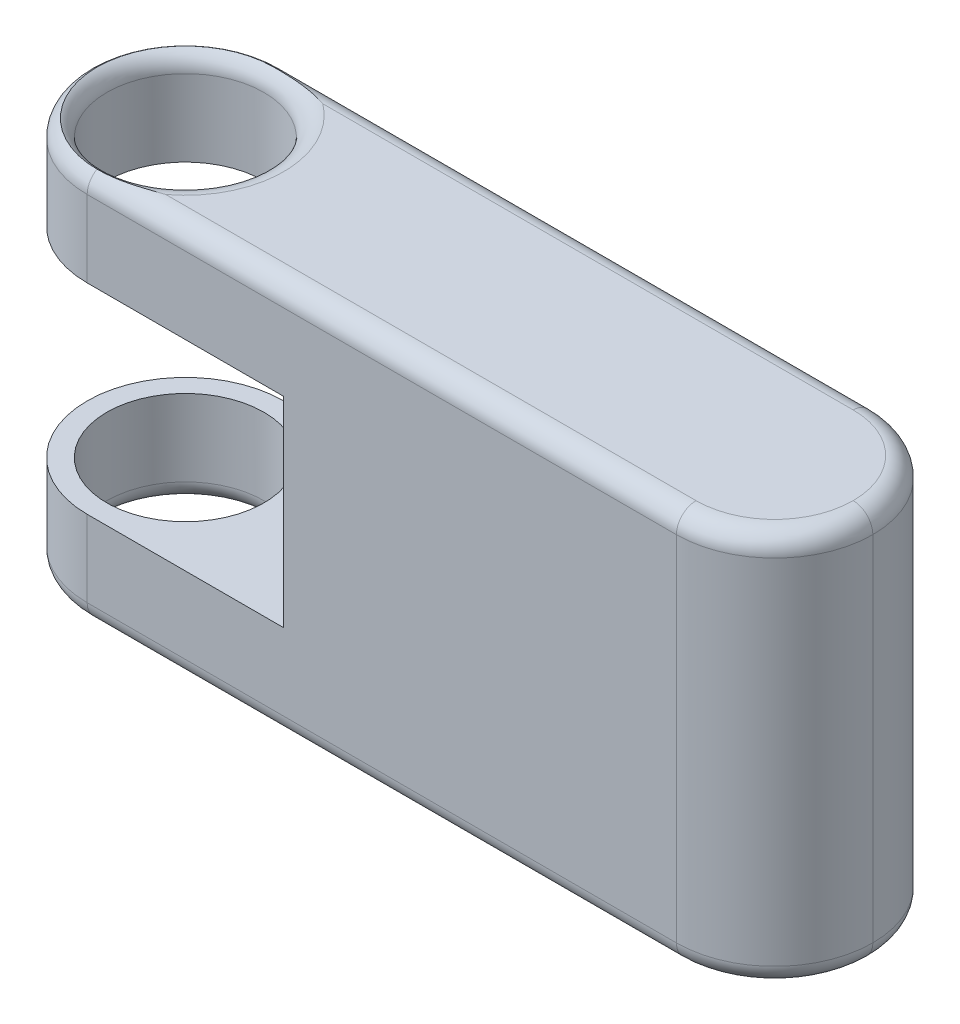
ISO-10303-21;
HEADER;
FILE_DESCRIPTION(('STEP AP214'),'2;1');
FILE_NAME('part.step','',(''),(''),'','','');
FILE_SCHEMA(('AUTOMOTIVE_DESIGN { 1 0 10303 214 1 1 1 1 }'));
ENDSEC;
DATA;
#1=APPLICATION_CONTEXT('core data for automotive mechanical design processes');
#2=APPLICATION_PROTOCOL_DEFINITION('international standard','automotive_design',2000,#1);
#3=PRODUCT_CONTEXT('',#1,'mechanical');
#4=PRODUCT('Part','Part','',(#3));
#5=PRODUCT_RELATED_PRODUCT_CATEGORY('part','',(#4));
#6=PRODUCT_DEFINITION_FORMATION('','',#4);
#7=PRODUCT_DEFINITION_CONTEXT('part definition',#1,'design');
#8=PRODUCT_DEFINITION('design','',#6,#7);
#9=PRODUCT_DEFINITION_SHAPE('','',#8);
#10=(LENGTH_UNIT() NAMED_UNIT(*) SI_UNIT(.MILLI.,.METRE.));
#11=(NAMED_UNIT(*) PLANE_ANGLE_UNIT() SI_UNIT($,.RADIAN.));
#12=(NAMED_UNIT(*) SI_UNIT($,.STERADIAN.) SOLID_ANGLE_UNIT());
#13=UNCERTAINTY_MEASURE_WITH_UNIT(LENGTH_MEASURE(1.E-05),#10,'distance_accuracy_value','');
#14=(GEOMETRIC_REPRESENTATION_CONTEXT(3) GLOBAL_UNCERTAINTY_ASSIGNED_CONTEXT((#13)) GLOBAL_UNIT_ASSIGNED_CONTEXT((#10,
#11,#12)) REPRESENTATION_CONTEXT('',''));
#15=CARTESIAN_POINT('',(0.,0.,0.));
#16=DIRECTION('',(0.,0.,1.));
#17=DIRECTION('',(1.,0.,0.));
#18=AXIS2_PLACEMENT_3D('',#15,#16,#17);
#19=CARTESIAN_POINT('',(150.,-49.,100.));
#20=DIRECTION('',(0.,1.,0.));
#21=DIRECTION('',(-1.,0.,0.));
#22=AXIS2_PLACEMENT_3D('',#19,#20,#21);
#23=PLANE('',#22);
#24=CARTESIAN_POINT('',(50.,-49.0000000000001,50.));
#25=DIRECTION('',(0.,1.,0.));
#26=DIRECTION('',(-1.,0.,0.));
#27=AXIS2_PLACEMENT_3D('',#24,#25,#26);
#28=CIRCLE('',#27,40.);
#29=CARTESIAN_POINT('',(9.99999999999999,-49.0000000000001,50.));
#30=VERTEX_POINT('',#29);
#31=EDGE_CURVE('E378',#30,#30,#28,.T.);
#32=ORIENTED_EDGE('',*,*,#31,.T.);
#33=EDGE_LOOP('',(#32));
#34=FACE_BOUND('',#33,.T.);
#35=CARTESIAN_POINT('',(50.,-49.,50.));
#36=DIRECTION('',(0.,1.,0.));
#37=DIRECTION('',(-1.,0.,0.));
#38=AXIS2_PLACEMENT_3D('',#35,#36,#37);
#39=CIRCLE('',#38,50.);
#40=CARTESIAN_POINT('',(50.,-49.,100.));
#41=VERTEX_POINT('',#40);
#42=CARTESIAN_POINT('',(0.,-49.0000000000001,50.));
#43=VERTEX_POINT('',#42);
#44=EDGE_CURVE('E390',#41,#43,#39,.F.);
#45=ORIENTED_EDGE('',*,*,#44,.T.);
#46=CARTESIAN_POINT('',(50.,-49.,50.));
#47=DIRECTION('',(0.,1.,0.));
#48=DIRECTION('',(-1.,0.,0.));
#49=AXIS2_PLACEMENT_3D('',#46,#47,#48);
#50=CIRCLE('',#49,50.);
#51=CARTESIAN_POINT('',(50.,-49.,0.));
#52=VERTEX_POINT('',#51);
#53=EDGE_CURVE('E400',#43,#52,#50,.F.);
#54=ORIENTED_EDGE('',*,*,#53,.T.);
#55=DIRECTION('',(1.,0.,0.));
#56=VECTOR('',#55,1.);
#57=CARTESIAN_POINT('',(150.,-49.,0.));
#58=LINE('',#57,#56);
#59=CARTESIAN_POINT('',(150.,-49.,0.));
#60=VERTEX_POINT('',#59);
#61=EDGE_CURVE('E364',#52,#60,#58,.T.);
#62=ORIENTED_EDGE('',*,*,#61,.T.);
#63=DIRECTION('',(0.,0.,-1.));
#64=VECTOR('',#63,1.);
#65=CARTESIAN_POINT('',(150.,-49.,100.));
#66=LINE('',#65,#64);
#67=CARTESIAN_POINT('',(150.,-49.,100.));
#68=VERTEX_POINT('',#67);
#69=EDGE_CURVE('E362',#68,#60,#66,.T.);
#70=ORIENTED_EDGE('',*,*,#69,.F.);
#71=DIRECTION('',(1.,0.,0.));
#72=VECTOR('',#71,1.);
#73=CARTESIAN_POINT('',(150.,-49.,100.));
#74=LINE('',#73,#72);
#75=EDGE_CURVE('E346',#41,#68,#74,.T.);
#76=ORIENTED_EDGE('',*,*,#75,.F.);
#77=EDGE_LOOP('',(#45,#54,#62,#70,#76));
#78=FACE_BOUND('',#77,.T.);
#79=ADVANCED_FACE('F37',(#34,#78),#23,.F.);
#80=CARTESIAN_POINT('',(150.,-151.,100.));
#81=DIRECTION('',(1.,0.,0.));
#82=DIRECTION('',(0.,0.,-1.));
#83=AXIS2_PLACEMENT_3D('',#80,#81,#82);
#84=PLANE('',#83);
#85=DIRECTION('',(0.,-1.,0.));
#86=VECTOR('',#85,1.);
#87=CARTESIAN_POINT('',(150.,-151.,0.));
#88=LINE('',#87,#86);
#89=CARTESIAN_POINT('',(150.,-151.,0.));
#90=VERTEX_POINT('',#89);
#91=EDGE_CURVE('E377',#60,#90,#88,.T.);
#92=ORIENTED_EDGE('',*,*,#91,.T.);
#93=DIRECTION('',(0.,0.,-1.));
#94=VECTOR('',#93,1.);
#95=CARTESIAN_POINT('',(150.,-151.,100.));
#96=LINE('',#95,#94);
#97=CARTESIAN_POINT('',(150.,-151.,100.));
#98=VERTEX_POINT('',#97);
#99=EDGE_CURVE('E367',#98,#90,#96,.T.);
#100=ORIENTED_EDGE('',*,*,#99,.F.);
#101=DIRECTION('',(0.,-1.,0.));
#102=VECTOR('',#101,1.);
#103=CARTESIAN_POINT('',(150.,-151.,100.));
#104=LINE('',#103,#102);
#105=EDGE_CURVE('E352',#68,#98,#104,.T.);
#106=ORIENTED_EDGE('',*,*,#105,.F.);
#107=ORIENTED_EDGE('',*,*,#69,.T.);
#108=EDGE_LOOP('',(#92,#100,#106,#107));
#109=FACE_BOUND('',#108,.T.);
#110=ADVANCED_FACE('F140',(#109),#84,.F.);
#111=CARTESIAN_POINT('',(0.,-151.,100.));
#112=DIRECTION('',(0.,-1.,0.));
#113=DIRECTION('',(0.,0.,-1.));
#114=AXIS2_PLACEMENT_3D('',#111,#112,#113);
#115=PLANE('',#114);
#116=CARTESIAN_POINT('',(50.,-151.,50.));
#117=DIRECTION('',(0.,-1.,0.));
#118=DIRECTION('',(0.,0.,-1.));
#119=AXIS2_PLACEMENT_3D('',#116,#117,#118);
#120=CIRCLE('',#119,40.);
#121=CARTESIAN_POINT('',(50.,-151.,10.));
#122=VERTEX_POINT('',#121);
#123=EDGE_CURVE('E462',#122,#122,#120,.T.);
#124=ORIENTED_EDGE('',*,*,#123,.T.);
#125=EDGE_LOOP('',(#124));
#126=FACE_BOUND('',#125,.T.);
#127=DIRECTION('',(-1.,0.,0.));
#128=VECTOR('',#127,1.);
#129=CARTESIAN_POINT('',(0.,-151.,0.));
#130=LINE('',#129,#128);
#131=CARTESIAN_POINT('',(50.,-151.,0.));
#132=VERTEX_POINT('',#131);
#133=EDGE_CURVE('E359',#90,#132,#130,.T.);
#134=ORIENTED_EDGE('',*,*,#133,.T.);
#135=CARTESIAN_POINT('',(50.,-151.,50.));
#136=DIRECTION('',(0.,-1.,0.));
#137=DIRECTION('',(0.,0.,-1.));
#138=AXIS2_PLACEMENT_3D('',#135,#136,#137);
#139=CIRCLE('',#138,50.);
#140=CARTESIAN_POINT('',(0.,-151.,50.));
#141=VERTEX_POINT('',#140);
#142=EDGE_CURVE('E397',#132,#141,#139,.F.);
#143=ORIENTED_EDGE('',*,*,#142,.T.);
#144=CARTESIAN_POINT('',(50.,-151.,50.));
#145=DIRECTION('',(0.,-1.,0.));
#146=DIRECTION('',(0.,0.,-1.));
#147=AXIS2_PLACEMENT_3D('',#144,#145,#146);
#148=CIRCLE('',#147,50.);
#149=CARTESIAN_POINT('',(50.,-151.,100.));
#150=VERTEX_POINT('',#149);
#151=EDGE_CURVE('E387',#141,#150,#148,.F.);
#152=ORIENTED_EDGE('',*,*,#151,.T.);
#153=DIRECTION('',(-1.,0.,0.));
#154=VECTOR('',#153,1.);
#155=CARTESIAN_POINT('',(0.,-151.,100.));
#156=LINE('',#155,#154);
#157=EDGE_CURVE('E371',#98,#150,#156,.T.);
#158=ORIENTED_EDGE('',*,*,#157,.F.);
#159=ORIENTED_EDGE('',*,*,#99,.T.);
#160=EDGE_LOOP('',(#134,#143,#152,#158,#159));
#161=FACE_BOUND('',#160,.T.);
#162=ADVANCED_FACE('F146',(#126,#161),#115,.F.);
#163=CARTESIAN_POINT('',(400.,-200.,100.));
#164=DIRECTION('',(0.,1.,0.));
#165=DIRECTION('',(-1.,0.,0.));
#166=AXIS2_PLACEMENT_3D('',#163,#164,#165);
#167=PLANE('',#166);
#168=CARTESIAN_POINT('',(350.,-200.,50.));
#169=DIRECTION('',(0.,1.,0.));
#170=DIRECTION('',(-1.,0.,0.));
#171=AXIS2_PLACEMENT_3D('',#168,#169,#170);
#172=CIRCLE('',#171,40.);
#173=CARTESIAN_POINT('',(390.,-200.,50.));
#174=VERTEX_POINT('',#173);
#175=CARTESIAN_POINT('',(350.,-200.,90.0000000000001));
#176=VERTEX_POINT('',#175);
#177=EDGE_CURVE('E56',#174,#176,#172,.F.);
#178=ORIENTED_EDGE('',*,*,#177,.T.);
#179=DIRECTION('',(1.,0.,0.));
#180=VECTOR('',#179,1.);
#181=CARTESIAN_POINT('',(400.,-200.,90.0000000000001));
#182=LINE('',#181,#180);
#183=CARTESIAN_POINT('',(79.9999999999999,-200.,90.0000000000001));
#184=VERTEX_POINT('',#183);
#185=EDGE_CURVE('E47',#176,#184,#182,.F.);
#186=ORIENTED_EDGE('',*,*,#185,.T.);
#187=CARTESIAN_POINT('',(50.,-200.,50.));
#188=DIRECTION('',(0.,1.,0.));
#189=DIRECTION('',(-1.,0.,0.));
#190=AXIS2_PLACEMENT_3D('',#187,#188,#189);
#191=CIRCLE('',#190,50.);
#192=CARTESIAN_POINT('',(80.,-200.,10.));
#193=VERTEX_POINT('',#192);
#194=EDGE_CURVE('E109',#184,#193,#191,.T.);
#195=ORIENTED_EDGE('',*,*,#194,.T.);
#196=DIRECTION('',(1.,0.,0.));
#197=VECTOR('',#196,1.);
#198=CARTESIAN_POINT('',(350.,-200.,10.));
#199=LINE('',#198,#197);
#200=CARTESIAN_POINT('',(350.,-200.,10.));
#201=VERTEX_POINT('',#200);
#202=EDGE_CURVE('E245',#193,#201,#199,.T.);
#203=ORIENTED_EDGE('',*,*,#202,.T.);
#204=CARTESIAN_POINT('',(350.,-200.,50.));
#205=DIRECTION('',(0.,1.,0.));
#206=DIRECTION('',(-1.,0.,0.));
#207=AXIS2_PLACEMENT_3D('',#204,#205,#206);
#208=CIRCLE('',#207,40.);
#209=EDGE_CURVE('E251',#201,#174,#208,.F.);
#210=ORIENTED_EDGE('',*,*,#209,.T.);
#211=EDGE_LOOP('',(#178,#186,#195,#203,#210));
#212=FACE_BOUND('',#211,.T.);
#213=ADVANCED_FACE('F258',(#212),#167,.F.);
#214=CARTESIAN_POINT('',(0.,0.,100.));
#215=DIRECTION('',(0.,-1.,0.));
#216=DIRECTION('',(0.,0.,-1.));
#217=AXIS2_PLACEMENT_3D('',#214,#215,#216);
#218=PLANE('',#217);
#219=CARTESIAN_POINT('',(350.,0.,50.));
#220=DIRECTION('',(0.,-1.,0.));
#221=DIRECTION('',(0.,0.,-1.));
#222=AXIS2_PLACEMENT_3D('',#219,#220,#221);
#223=CIRCLE('',#222,40.);
#224=CARTESIAN_POINT('',(350.,0.,90.0000000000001));
#225=VERTEX_POINT('',#224);
#226=CARTESIAN_POINT('',(390.,0.,50.));
#227=VERTEX_POINT('',#226);
#228=EDGE_CURVE('E422',#225,#227,#223,.F.);
#229=ORIENTED_EDGE('',*,*,#228,.T.);
#230=CARTESIAN_POINT('',(350.,0.,50.));
#231=DIRECTION('',(0.,-1.,0.));
#232=DIRECTION('',(0.,0.,-1.));
#233=AXIS2_PLACEMENT_3D('',#230,#231,#232);
#234=CIRCLE('',#233,40.);
#235=CARTESIAN_POINT('',(350.,0.,10.));
#236=VERTEX_POINT('',#235);
#237=EDGE_CURVE('E424',#227,#236,#234,.F.);
#238=ORIENTED_EDGE('',*,*,#237,.T.);
#239=DIRECTION('',(-1.,0.,0.));
#240=VECTOR('',#239,1.);
#241=CARTESIAN_POINT('',(50.,0.,10.));
#242=LINE('',#241,#240);
#243=CARTESIAN_POINT('',(80.,0.,10.));
#244=VERTEX_POINT('',#243);
#245=EDGE_CURVE('E417',#236,#244,#242,.T.);
#246=ORIENTED_EDGE('',*,*,#245,.T.);
#247=CARTESIAN_POINT('',(50.,0.,50.));
#248=DIRECTION('',(0.,-1.,0.));
#249=DIRECTION('',(0.,0.,-1.));
#250=AXIS2_PLACEMENT_3D('',#247,#248,#249);
#251=CIRCLE('',#250,50.);
#252=CARTESIAN_POINT('',(79.9999999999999,0.,90.0000000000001));
#253=VERTEX_POINT('',#252);
#254=EDGE_CURVE('E415',#244,#253,#251,.T.);
#255=ORIENTED_EDGE('',*,*,#254,.T.);
#256=DIRECTION('',(-1.,0.,0.));
#257=VECTOR('',#256,1.);
#258=CARTESIAN_POINT('',(0.,0.,90.0000000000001));
#259=LINE('',#258,#257);
#260=EDGE_CURVE('E419',#253,#225,#259,.F.);
#261=ORIENTED_EDGE('',*,*,#260,.T.);
#262=EDGE_LOOP('',(#229,#238,#246,#255,#261));
#263=FACE_BOUND('',#262,.T.);
#264=ADVANCED_FACE('F489',(#263),#218,.F.);
#265=CARTESIAN_POINT('',(0.,0.,100.));
#266=DIRECTION('',(0.,0.,-1.));
#267=DIRECTION('',(-1.,0.,0.));
#268=AXIS2_PLACEMENT_3D('',#265,#266,#267);
#269=PLANE('',#268);
#270=DIRECTION('',(0.,1.,0.));
#271=VECTOR('',#270,1.);
#272=CARTESIAN_POINT('',(350.,0.,100.));
#273=LINE('',#272,#271);
#274=CARTESIAN_POINT('',(350.,-190.,100.));
#275=VERTEX_POINT('',#274);
#276=CARTESIAN_POINT('',(350.,-10.0000000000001,100.));
#277=VERTEX_POINT('',#276);
#278=EDGE_CURVE('E405',#275,#277,#273,.T.);
#279=ORIENTED_EDGE('',*,*,#278,.T.);
#280=DIRECTION('',(-1.,0.,0.));
#281=VECTOR('',#280,1.);
#282=CARTESIAN_POINT('',(0.,-10.0000000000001,100.));
#283=LINE('',#282,#281);
#284=CARTESIAN_POINT('',(50.,-10.0000000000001,100.));
#285=VERTEX_POINT('',#284);
#286=EDGE_CURVE('E413',#277,#285,#283,.T.);
#287=ORIENTED_EDGE('',*,*,#286,.T.);
#288=DIRECTION('',(0.,-1.,0.));
#289=VECTOR('',#288,1.);
#290=CARTESIAN_POINT('',(50.,0.,100.));
#291=LINE('',#290,#289);
#292=EDGE_CURVE('E356',#285,#41,#291,.T.);
#293=ORIENTED_EDGE('',*,*,#292,.T.);
#294=ORIENTED_EDGE('',*,*,#75,.T.);
#295=ORIENTED_EDGE('',*,*,#105,.T.);
#296=ORIENTED_EDGE('',*,*,#157,.T.);
#297=DIRECTION('',(0.,-1.,0.));
#298=VECTOR('',#297,1.);
#299=CARTESIAN_POINT('',(50.,0.,100.));
#300=LINE('',#299,#298);
#301=CARTESIAN_POINT('',(50.,-190.,100.));
#302=VERTEX_POINT('',#301);
#303=EDGE_CURVE('E366',#150,#302,#300,.T.);
#304=ORIENTED_EDGE('',*,*,#303,.T.);
#305=DIRECTION('',(1.,0.,0.));
#306=VECTOR('',#305,1.);
#307=CARTESIAN_POINT('',(0.,-190.,100.));
#308=LINE('',#307,#306);
#309=EDGE_CURVE('E95',#302,#275,#308,.T.);
#310=ORIENTED_EDGE('',*,*,#309,.T.);
#311=EDGE_LOOP('',(#279,#287,#293,#294,#295,#296,#304,#310));
#312=FACE_BOUND('',#311,.T.);
#313=ADVANCED_FACE('F349',(#312),#269,.F.);
#314=CARTESIAN_POINT('',(0.,0.,0.));
#315=DIRECTION('',(0.,0.,-1.));
#316=DIRECTION('',(-1.,0.,0.));
#317=AXIS2_PLACEMENT_3D('',#314,#315,#316);
#318=PLANE('',#317);
#319=DIRECTION('',(0.,-1.,0.));
#320=VECTOR('',#319,1.);
#321=CARTESIAN_POINT('',(50.,0.,0.));
#322=LINE('',#321,#320);
#323=CARTESIAN_POINT('',(50.,-10.0000000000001,0.));
#324=VERTEX_POINT('',#323);
#325=EDGE_CURVE('E402',#52,#324,#322,.F.);
#326=ORIENTED_EDGE('',*,*,#325,.T.);
#327=DIRECTION('',(-1.,0.,0.));
#328=VECTOR('',#327,1.);
#329=CARTESIAN_POINT('',(350.,-10.0000000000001,0.));
#330=LINE('',#329,#328);
#331=CARTESIAN_POINT('',(350.,-10.0000000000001,0.));
#332=VERTEX_POINT('',#331);
#333=EDGE_CURVE('E432',#324,#332,#330,.F.);
#334=ORIENTED_EDGE('',*,*,#333,.T.);
#335=DIRECTION('',(0.,1.,0.));
#336=VECTOR('',#335,1.);
#337=CARTESIAN_POINT('',(350.,-200.,0.));
#338=LINE('',#337,#336);
#339=CARTESIAN_POINT('',(350.,-190.,0.));
#340=VERTEX_POINT('',#339);
#341=EDGE_CURVE('E409',#332,#340,#338,.F.);
#342=ORIENTED_EDGE('',*,*,#341,.T.);
#343=DIRECTION('',(1.,0.,0.));
#344=VECTOR('',#343,1.);
#345=CARTESIAN_POINT('',(50.,-190.,0.));
#346=LINE('',#345,#344);
#347=CARTESIAN_POINT('',(50.,-190.,0.));
#348=VERTEX_POINT('',#347);
#349=EDGE_CURVE('E430',#340,#348,#346,.F.);
#350=ORIENTED_EDGE('',*,*,#349,.T.);
#351=DIRECTION('',(0.,-1.,0.));
#352=VECTOR('',#351,1.);
#353=CARTESIAN_POINT('',(50.,-151.,0.));
#354=LINE('',#353,#352);
#355=EDGE_CURVE('E395',#348,#132,#354,.F.);
#356=ORIENTED_EDGE('',*,*,#355,.T.);
#357=ORIENTED_EDGE('',*,*,#133,.F.);
#358=ORIENTED_EDGE('',*,*,#91,.F.);
#359=ORIENTED_EDGE('',*,*,#61,.F.);
#360=EDGE_LOOP('',(#326,#334,#342,#350,#356,#357,#358,#359));
#361=FACE_BOUND('',#360,.T.);
#362=ADVANCED_FACE('F496',(#361),#318,.T.);
#363=CARTESIAN_POINT('',(50.,-200.,50.));
#364=DIRECTION('',(0.,1.,0.));
#365=DIRECTION('',(0.,0.,1.));
#366=AXIS2_PLACEMENT_3D('',#363,#364,#365);
#367=CYLINDRICAL_SURFACE('',#366,40.);
#368=CARTESIAN_POINT('',(50.,-10.0000000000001,50.));
#369=DIRECTION('',(0.,-1.,0.));
#370=DIRECTION('',(0.,0.,-1.));
#371=AXIS2_PLACEMENT_3D('',#368,#369,#370);
#372=CIRCLE('',#371,40.);
#373=CARTESIAN_POINT('',(50.,-10.0000000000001,10.));
#374=VERTEX_POINT('',#373);
#375=EDGE_CURVE('E440',#374,#374,#372,.F.);
#376=ORIENTED_EDGE('',*,*,#375,.T.);
#377=EDGE_LOOP('',(#376));
#378=FACE_BOUND('',#377,.T.);
#379=ORIENTED_EDGE('',*,*,#31,.F.);
#380=EDGE_LOOP('',(#379));
#381=FACE_BOUND('',#380,.T.);
#382=ADVANCED_FACE('F505',(#378,#381),#367,.F.);
#383=CARTESIAN_POINT('',(50.,-190.,50.));
#384=DIRECTION('',(0.,1.,0.));
#385=DIRECTION('',(-1.,0.,0.));
#386=AXIS2_PLACEMENT_3D('',#383,#384,#385);
#387=CIRCLE('',#386,40.);
#388=CARTESIAN_POINT('',(9.99999999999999,-190.,50.));
#389=VERTEX_POINT('',#388);
#390=EDGE_CURVE('E11',#389,#389,#387,.F.);
#391=ORIENTED_EDGE('',*,*,#390,.T.);
#392=EDGE_LOOP('',(#391));
#393=FACE_BOUND('',#392,.T.);
#394=ORIENTED_EDGE('',*,*,#123,.F.);
#395=EDGE_LOOP('',(#394));
#396=FACE_BOUND('',#395,.T.);
#397=ADVANCED_FACE('F157',(#393,#396),#367,.F.);
#398=CARTESIAN_POINT('',(50.,0.,50.));
#399=DIRECTION('',(0.,-1.,0.));
#400=DIRECTION('',(0.,0.,-1.));
#401=AXIS2_PLACEMENT_3D('',#398,#399,#400);
#402=CYLINDRICAL_SURFACE('',#401,50.);
#403=DIRECTION('',(0.,-1.,0.));
#404=VECTOR('',#403,1.);
#405=CARTESIAN_POINT('',(0.,-200.,50.));
#406=LINE('',#405,#404);
#407=CARTESIAN_POINT('',(0.,-190.,50.));
#408=VERTEX_POINT('',#407);
#409=EDGE_CURVE('E385',#408,#141,#406,.F.);
#410=ORIENTED_EDGE('',*,*,#409,.F.);
#411=CARTESIAN_POINT('',(50.,-190.,50.));
#412=DIRECTION('',(0.,1.,0.));
#413=DIRECTION('',(-1.,0.,0.));
#414=AXIS2_PLACEMENT_3D('',#411,#412,#413);
#415=CIRCLE('',#414,50.);
#416=EDGE_CURVE('E254',#408,#302,#415,.T.);
#417=ORIENTED_EDGE('',*,*,#416,.T.);
#418=ORIENTED_EDGE('',*,*,#303,.F.);
#419=ORIENTED_EDGE('',*,*,#151,.F.);
#420=EDGE_LOOP('',(#410,#417,#418,#419));
#421=FACE_BOUND('',#420,.T.);
#422=ADVANCED_FACE('F153',(#421),#402,.T.);
#423=CARTESIAN_POINT('',(50.,0.,50.));
#424=DIRECTION('',(0.,-1.,0.));
#425=DIRECTION('',(0.,0.,-1.));
#426=AXIS2_PLACEMENT_3D('',#423,#424,#425);
#427=CYLINDRICAL_SURFACE('',#426,50.);
#428=ORIENTED_EDGE('',*,*,#292,.F.);
#429=CARTESIAN_POINT('',(50.,-10.0000000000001,50.));
#430=DIRECTION('',(0.,-1.,0.));
#431=DIRECTION('',(0.,0.,-1.));
#432=AXIS2_PLACEMENT_3D('',#429,#430,#431);
#433=CIRCLE('',#432,50.);
#434=CARTESIAN_POINT('',(0.,-10.0000000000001,50.));
#435=VERTEX_POINT('',#434);
#436=EDGE_CURVE('E426',#285,#435,#433,.T.);
#437=ORIENTED_EDGE('',*,*,#436,.T.);
#438=DIRECTION('',(0.,-1.,0.));
#439=VECTOR('',#438,1.);
#440=CARTESIAN_POINT('',(0.,-49.0000000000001,50.));
#441=LINE('',#440,#439);
#442=EDGE_CURVE('E392',#43,#435,#441,.F.);
#443=ORIENTED_EDGE('',*,*,#442,.F.);
#444=ORIENTED_EDGE('',*,*,#44,.F.);
#445=EDGE_LOOP('',(#428,#437,#443,#444));
#446=FACE_BOUND('',#445,.T.);
#447=ADVANCED_FACE('F156',(#446),#427,.T.);
#448=CARTESIAN_POINT('',(50.,-200.,50.));
#449=DIRECTION('',(0.,1.,0.));
#450=DIRECTION('',(0.,0.,1.));
#451=AXIS2_PLACEMENT_3D('',#448,#449,#450);
#452=CYLINDRICAL_SURFACE('',#451,50.);
#453=ORIENTED_EDGE('',*,*,#355,.F.);
#454=CARTESIAN_POINT('',(50.,-190.,50.));
#455=DIRECTION('',(0.,1.,0.));
#456=DIRECTION('',(-1.,0.,0.));
#457=AXIS2_PLACEMENT_3D('',#454,#455,#456);
#458=CIRCLE('',#457,50.);
#459=EDGE_CURVE('E443',#348,#408,#458,.T.);
#460=ORIENTED_EDGE('',*,*,#459,.T.);
#461=ORIENTED_EDGE('',*,*,#409,.T.);
#462=ORIENTED_EDGE('',*,*,#142,.F.);
#463=EDGE_LOOP('',(#453,#460,#461,#462));
#464=FACE_BOUND('',#463,.T.);
#465=ADVANCED_FACE('F161',(#464),#452,.T.);
#466=CARTESIAN_POINT('',(50.,-49.0000000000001,50.));
#467=DIRECTION('',(0.,1.,0.));
#468=DIRECTION('',(0.,0.,1.));
#469=AXIS2_PLACEMENT_3D('',#466,#467,#468);
#470=CYLINDRICAL_SURFACE('',#469,50.);
#471=ORIENTED_EDGE('',*,*,#442,.T.);
#472=CARTESIAN_POINT('',(50.,-10.0000000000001,50.));
#473=DIRECTION('',(0.,-1.,0.));
#474=DIRECTION('',(0.,0.,-1.));
#475=AXIS2_PLACEMENT_3D('',#472,#473,#474);
#476=CIRCLE('',#475,50.);
#477=EDGE_CURVE('E428',#435,#324,#476,.T.);
#478=ORIENTED_EDGE('',*,*,#477,.T.);
#479=ORIENTED_EDGE('',*,*,#325,.F.);
#480=ORIENTED_EDGE('',*,*,#53,.F.);
#481=EDGE_LOOP('',(#471,#478,#479,#480));
#482=FACE_BOUND('',#481,.T.);
#483=ADVANCED_FACE('F165',(#482),#470,.T.);
#484=CARTESIAN_POINT('',(350.,0.,50.));
#485=DIRECTION('',(0.,1.,0.));
#486=DIRECTION('',(0.,0.,1.));
#487=AXIS2_PLACEMENT_3D('',#484,#485,#486);
#488=CYLINDRICAL_SURFACE('',#487,50.);
#489=DIRECTION('',(0.,1.,0.));
#490=VECTOR('',#489,1.);
#491=CARTESIAN_POINT('',(400.,0.,50.));
#492=LINE('',#491,#490);
#493=CARTESIAN_POINT('',(400.,-10.0000000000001,50.));
#494=VERTEX_POINT('',#493);
#495=CARTESIAN_POINT('',(400.,-190.,50.));
#496=VERTEX_POINT('',#495);
#497=EDGE_CURVE('E407',#494,#496,#492,.F.);
#498=ORIENTED_EDGE('',*,*,#497,.F.);
#499=CARTESIAN_POINT('',(350.,-10.0000000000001,50.));
#500=DIRECTION('',(0.,-1.,0.));
#501=DIRECTION('',(0.,0.,-1.));
#502=AXIS2_PLACEMENT_3D('',#499,#500,#501);
#503=CIRCLE('',#502,50.);
#504=EDGE_CURVE('E438',#494,#277,#503,.T.);
#505=ORIENTED_EDGE('',*,*,#504,.T.);
#506=ORIENTED_EDGE('',*,*,#278,.F.);
#507=CARTESIAN_POINT('',(350.,-190.,50.));
#508=DIRECTION('',(0.,1.,0.));
#509=DIRECTION('',(-1.,0.,0.));
#510=AXIS2_PLACEMENT_3D('',#507,#508,#509);
#511=CIRCLE('',#510,50.);
#512=EDGE_CURVE('E273',#275,#496,#511,.T.);
#513=ORIENTED_EDGE('',*,*,#512,.T.);
#514=EDGE_LOOP('',(#498,#505,#506,#513));
#515=FACE_BOUND('',#514,.T.);
#516=ADVANCED_FACE('F169',(#515),#488,.T.);
#517=CARTESIAN_POINT('',(350.,0.,50.));
#518=DIRECTION('',(0.,-1.,0.));
#519=DIRECTION('',(0.,0.,-1.));
#520=AXIS2_PLACEMENT_3D('',#517,#518,#519);
#521=CYLINDRICAL_SURFACE('',#520,50.);
#522=ORIENTED_EDGE('',*,*,#341,.F.);
#523=CARTESIAN_POINT('',(350.,-10.0000000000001,50.));
#524=DIRECTION('',(0.,-1.,0.));
#525=DIRECTION('',(0.,0.,-1.));
#526=AXIS2_PLACEMENT_3D('',#523,#524,#525);
#527=CIRCLE('',#526,50.);
#528=EDGE_CURVE('E435',#332,#494,#527,.T.);
#529=ORIENTED_EDGE('',*,*,#528,.T.);
#530=ORIENTED_EDGE('',*,*,#497,.T.);
#531=CARTESIAN_POINT('',(350.,-190.,50.));
#532=DIRECTION('',(0.,1.,0.));
#533=DIRECTION('',(-1.,0.,0.));
#534=AXIS2_PLACEMENT_3D('',#531,#532,#533);
#535=CIRCLE('',#534,50.);
#536=EDGE_CURVE('E271',#496,#340,#535,.T.);
#537=ORIENTED_EDGE('',*,*,#536,.T.);
#538=EDGE_LOOP('',(#522,#529,#530,#537));
#539=FACE_BOUND('',#538,.T.);
#540=ADVANCED_FACE('F173',(#539),#521,.T.);
#541=CARTESIAN_POINT('',(350.,-10.0000000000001,50.));
#542=DIRECTION('',(0.,-1.,0.));
#543=DIRECTION('',(0.,0.,-1.));
#544=AXIS2_PLACEMENT_3D('',#541,#542,#543);
#545=TOROIDAL_SURFACE('',#544,40.,10.);
#546=CARTESIAN_POINT('',(390.,-10.0000000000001,50.));
#547=DIRECTION('',(0.,0.,1.));
#548=DIRECTION('',(1.,0.,0.));
#549=AXIS2_PLACEMENT_3D('',#546,#547,#548);
#550=CIRCLE('',#549,10.);
#551=EDGE_CURVE('E466',#494,#227,#550,.T.);
#552=ORIENTED_EDGE('',*,*,#551,.F.);
#553=ORIENTED_EDGE('',*,*,#528,.F.);
#554=CARTESIAN_POINT('',(350.,-10.0000000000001,10.));
#555=DIRECTION('',(-1.,0.,0.));
#556=DIRECTION('',(0.,0.,1.));
#557=AXIS2_PLACEMENT_3D('',#554,#555,#556);
#558=CIRCLE('',#557,10.);
#559=EDGE_CURVE('E463',#236,#332,#558,.T.);
#560=ORIENTED_EDGE('',*,*,#559,.F.);
#561=ORIENTED_EDGE('',*,*,#237,.F.);
#562=EDGE_LOOP('',(#552,#553,#560,#561));
#563=FACE_BOUND('',#562,.T.);
#564=ADVANCED_FACE('F177',(#563),#545,.T.);
#565=CARTESIAN_POINT('',(50.,-10.0000000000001,50.));
#566=DIRECTION('',(0.,-1.,0.));
#567=DIRECTION('',(0.,0.,-1.));
#568=AXIS2_PLACEMENT_3D('',#565,#566,#567);
#569=TOROIDAL_SURFACE('',#568,40.,10.);
#570=CARTESIAN_POINT('',(50.,-10.0000000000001,10.));
#571=DIRECTION('',(1.,0.,0.));
#572=DIRECTION('',(0.,0.,-1.));
#573=AXIS2_PLACEMENT_3D('',#570,#571,#572);
#574=CIRCLE('',#573,10.);
#575=CARTESIAN_POINT('',(50.0000000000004,-1.33974596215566,5.00000000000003));
#576=VERTEX_POINT('',#575);
#577=EDGE_CURVE('E459',#324,#576,#574,.T.);
#578=ORIENTED_EDGE('',*,*,#577,.F.);
#579=ORIENTED_EDGE('',*,*,#477,.F.);
#580=CARTESIAN_POINT('',(10.,-10.0000000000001,50.));
#581=DIRECTION('',(0.,0.,1.));
#582=DIRECTION('',(1.,0.,0.));
#583=AXIS2_PLACEMENT_3D('',#580,#581,#582);
#584=CIRCLE('',#583,10.);
#585=CARTESIAN_POINT('',(5.,-1.33974596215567,50.));
#586=VERTEX_POINT('',#585);
#587=EDGE_CURVE('E469',#586,#435,#584,.T.);
#588=ORIENTED_EDGE('',*,*,#587,.F.);
#589=CARTESIAN_POINT('',(50.,-1.33974596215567,50.));
#590=DIRECTION('',(0.,-1.,0.));
#591=DIRECTION('',(0.,0.,-1.));
#592=AXIS2_PLACEMENT_3D('',#589,#590,#591);
#593=CIRCLE('',#592,45.);
#594=EDGE_CURVE('E208',#576,#586,#593,.F.);
#595=ORIENTED_EDGE('',*,*,#594,.F.);
#596=EDGE_LOOP('',(#578,#579,#588,#595));
#597=FACE_BOUND('',#596,.T.);
#598=ADVANCED_FACE('F222',(#597),#569,.T.);
#599=CARTESIAN_POINT('',(0.,-10.0000000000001,10.));
#600=DIRECTION('',(1.,0.,0.));
#601=DIRECTION('',(0.,0.,-1.));
#602=AXIS2_PLACEMENT_3D('',#599,#600,#601);
#603=CYLINDRICAL_SURFACE('',#602,10.);
#604=ORIENTED_EDGE('',*,*,#333,.F.);
#605=ORIENTED_EDGE('',*,*,#577,.T.);
#606=CARTESIAN_POINT('',(49.9998,-1.33974596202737,5.00000000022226));
#607=CARTESIAN_POINT('',(50.4207233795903,-1.33975555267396,4.99999800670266));
#608=CARTESIAN_POINT('',(50.8416457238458,-1.33804238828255,5.00295104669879));
#609=CARTESIAN_POINT('',(51.6833774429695,-1.33123650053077,5.01475934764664));
#610=CARTESIAN_POINT('',(52.1041868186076,-1.32614380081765,5.0236145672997));
#611=CARTESIAN_POINT('',(52.9455484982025,-1.31264541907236,5.0472182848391));
#612=CARTESIAN_POINT('',(53.3661008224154,-1.30424004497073,5.06196623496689));
#613=CARTESIAN_POINT('',(54.2068790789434,-1.28424841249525,5.0973393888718));
#614=CARTESIAN_POINT('',(54.6271050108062,-1.27266214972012,5.11796460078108));
#615=CARTESIAN_POINT('',(55.8866621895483,-1.23339304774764,5.18860044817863));
#616=CARTESIAN_POINT('',(56.7253802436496,-1.20119137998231,5.24738557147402));
#617=CARTESIAN_POINT('',(58.4004037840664,-1.12660938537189,5.38814037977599));
#618=CARTESIAN_POINT('',(59.2367092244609,-1.08422886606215,5.47011050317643));
#619=CARTESIAN_POINT('',(60.9059977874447,-0.991756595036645,5.65691351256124));
#620=CARTESIAN_POINT('',(61.7389820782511,-0.941667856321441,5.76173747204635));
#621=CARTESIAN_POINT('',(63.4014898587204,-0.836611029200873,5.99393844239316));
#622=CARTESIAN_POINT('',(64.2310133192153,-0.781642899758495,6.12131564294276));
#623=CARTESIAN_POINT('',(65.8862048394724,-0.669954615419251,6.39825888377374));
#624=CARTESIAN_POINT('',(66.7118729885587,-0.613234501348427,6.54782440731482));
#625=CARTESIAN_POINT('',(68.3590336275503,-0.501359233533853,6.86875473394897));
#626=CARTESIAN_POINT('',(69.1805262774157,-0.446204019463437,7.04011869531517));
#627=CARTESIAN_POINT('',(70.8418727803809,-0.33944948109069,7.4093032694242));
#628=CARTESIAN_POINT('',(71.6816018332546,-0.287991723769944,7.60772716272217));
#629=CARTESIAN_POINT('',(73.3560029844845,-0.194283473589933,8.02667796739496));
#630=CARTESIAN_POINT('',(74.1906753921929,-0.152032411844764,8.24720351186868));
#631=CARTESIAN_POINT('',(75.8539339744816,-0.0808437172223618,8.70963794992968));
#632=CARTESIAN_POINT('',(76.6825244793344,-0.0518954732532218,8.9515296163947));
#633=CARTESIAN_POINT('',(78.3337139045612,-0.0115875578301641,9.45621062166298));
#634=CARTESIAN_POINT('',(79.1563135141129,-0.000225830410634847,9.71899751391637));
#635=CARTESIAN_POINT('',(79.9836697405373,-1.11302372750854E-06,9.99455769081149));
#636=CARTESIAN_POINT('',(79.9918350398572,-1.95356823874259E-09,9.99727834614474));
#637=CARTESIAN_POINT('',(80.,4.11223297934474E-13,10.));
#638=B_SPLINE_CURVE_WITH_KNOTS('',3,(#606,#607,#608,#609,#610,#611,#612,#613,#614,#615,#616,
#617,#618,#619,#620,#621,#622,#623,#624,#625,#626,#627,#628,#629,#630,#631,#632,#633,#634,#635,
#636,#637),.UNSPECIFIED.,.F.,.F.,(4,2,2,2,2,2,2,2,2,2,2,2,2,2,2,4),(0.,1.26275443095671,
2.52550002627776,3.78812827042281,5.05075826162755,7.57449583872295,10.0982811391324,
12.6210824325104,15.1439049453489,17.6666687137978,20.1893350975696,22.7821647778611,
25.3748342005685,27.9654319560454,30.5557268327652,30.5815467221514),.UNSPECIFIED.);
#639=EDGE_CURVE('E199',#244,#576,#638,.F.);
#640=ORIENTED_EDGE('',*,*,#639,.F.);
#641=ORIENTED_EDGE('',*,*,#245,.F.);
#642=ORIENTED_EDGE('',*,*,#559,.T.);
#643=EDGE_LOOP('',(#604,#605,#640,#641,#642));
#644=FACE_BOUND('',#643,.T.);
#645=ADVANCED_FACE('F210',(#644),#603,.T.);
#646=CARTESIAN_POINT('',(350.,-10.0000000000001,50.));
#647=DIRECTION('',(0.,-1.,0.));
#648=DIRECTION('',(0.,0.,-1.));
#649=AXIS2_PLACEMENT_3D('',#646,#647,#648);
#650=TOROIDAL_SURFACE('',#649,40.,10.);
#651=ORIENTED_EDGE('',*,*,#551,.T.);
#652=ORIENTED_EDGE('',*,*,#228,.F.);
#653=CARTESIAN_POINT('',(350.,-10.0000000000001,90.0000000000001));
#654=DIRECTION('',(-1.,0.,0.));
#655=DIRECTION('',(0.,0.,1.));
#656=AXIS2_PLACEMENT_3D('',#653,#654,#655);
#657=CIRCLE('',#656,10.);
#658=EDGE_CURVE('E196',#277,#225,#657,.T.);
#659=ORIENTED_EDGE('',*,*,#658,.F.);
#660=ORIENTED_EDGE('',*,*,#504,.F.);
#661=EDGE_LOOP('',(#651,#652,#659,#660));
#662=FACE_BOUND('',#661,.T.);
#663=ADVANCED_FACE('F217',(#662),#650,.T.);
#664=CARTESIAN_POINT('',(50.,-10.0000000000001,50.));
#665=DIRECTION('',(0.,-1.,0.));
#666=DIRECTION('',(0.,0.,-1.));
#667=AXIS2_PLACEMENT_3D('',#664,#665,#666);
#668=TOROIDAL_SURFACE('',#667,40.,10.);
#669=CARTESIAN_POINT('',(50.,-1.33974596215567,50.));
#670=DIRECTION('',(0.,-1.,0.));
#671=DIRECTION('',(0.,0.,-1.));
#672=AXIS2_PLACEMENT_3D('',#669,#670,#671);
#673=CIRCLE('',#672,45.);
#674=CARTESIAN_POINT('',(50.,-1.33974596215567,95.));
#675=VERTEX_POINT('',#674);
#676=EDGE_CURVE('E471',#586,#675,#673,.F.);
#677=ORIENTED_EDGE('',*,*,#676,.F.);
#678=ORIENTED_EDGE('',*,*,#587,.T.);
#679=ORIENTED_EDGE('',*,*,#436,.F.);
#680=CARTESIAN_POINT('',(50.,-10.0000000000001,90.));
#681=DIRECTION('',(1.,0.,0.));
#682=DIRECTION('',(0.,0.,-1.));
#683=AXIS2_PLACEMENT_3D('',#680,#681,#682);
#684=CIRCLE('',#683,10.);
#685=EDGE_CURVE('E192',#675,#285,#684,.T.);
#686=ORIENTED_EDGE('',*,*,#685,.F.);
#687=EDGE_LOOP('',(#677,#678,#679,#686));
#688=FACE_BOUND('',#687,.T.);
#689=ADVANCED_FACE('F214',(#688),#668,.T.);
#690=CARTESIAN_POINT('',(50.,-10.0000000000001,50.));
#691=DIRECTION('',(0.,-1.,0.));
#692=DIRECTION('',(0.,0.,-1.));
#693=AXIS2_PLACEMENT_3D('',#690,#691,#692);
#694=TOROIDAL_SURFACE('',#693,50.,10.);
#695=ORIENTED_EDGE('',*,*,#375,.F.);
#696=EDGE_LOOP('',(#695));
#697=FACE_BOUND('',#696,.T.);
#698=ORIENTED_EDGE('',*,*,#594,.T.);
#699=ORIENTED_EDGE('',*,*,#676,.T.);
#700=CARTESIAN_POINT('',(79.9999999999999,4.11821301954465E-13,90.0000000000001));
#701=CARTESIAN_POINT('',(79.991835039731,-1.85317354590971E-09,90.0027216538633));
#702=CARTESIAN_POINT('',(79.9836697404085,-1.11292430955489E-06,90.0054423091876));
#703=CARTESIAN_POINT('',(79.1790519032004,-0.000219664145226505,90.2734292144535));
#704=CARTESIAN_POINT('',(78.3793784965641,-0.0109663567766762,90.5291930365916));
#705=CARTESIAN_POINT('',(76.7743372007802,-0.0492012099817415,91.0209948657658));
#706=CARTESIAN_POINT('',(75.9689685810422,-0.0766915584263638,91.2570302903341));
#707=CARTESIAN_POINT('',(74.3527187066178,-0.144446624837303,91.7088802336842));
#708=CARTESIAN_POINT('',(73.5418350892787,-0.184717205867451,91.9246854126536));
#709=CARTESIAN_POINT('',(71.915257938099,-0.274270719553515,92.3354609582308));
#710=CARTESIAN_POINT('',(71.0995640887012,-0.32355424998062,92.5304299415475));
#711=CARTESIAN_POINT('',(69.4627594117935,-0.427596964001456,92.8992864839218));
#712=CARTESIAN_POINT('',(68.6416433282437,-0.482362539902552,93.0731488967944));
#713=CARTESIAN_POINT('',(66.9952797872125,-0.593843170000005,93.3991003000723));
#714=CARTESIAN_POINT('',(66.1700325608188,-0.650558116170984,93.5511904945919));
#715=CARTESIAN_POINT('',(64.5159186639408,-0.762588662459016,93.8331772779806));
#716=CARTESIAN_POINT('',(63.6870531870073,-0.817904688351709,93.9630806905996));
#717=CARTESIAN_POINT('',(62.0258526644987,-0.92400446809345,94.2003817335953));
#718=CARTESIAN_POINT('',(61.1935177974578,-0.974788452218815,94.307780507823));
#719=CARTESIAN_POINT('',(59.5005306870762,-1.07037300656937,94.5026555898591));
#720=CARTESIAN_POINT('',(58.6397844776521,-1.11494569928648,94.5894297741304));
#721=CARTESIAN_POINT('',(56.9157105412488,-1.19349742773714,94.7384218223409));
#722=CARTESIAN_POINT('',(56.0523829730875,-1.22747710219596,94.800641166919));
#723=CARTESIAN_POINT('',(54.7564502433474,-1.26891993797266,94.8753478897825));
#724=CARTESIAN_POINT('',(54.3245124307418,-1.28114304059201,94.8971407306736));
#725=CARTESIAN_POINT('',(53.4602834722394,-1.30224141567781,94.9345174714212));
#726=CARTESIAN_POINT('',(53.0279923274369,-1.31111669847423,94.9501013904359));
#727=CARTESIAN_POINT('',(52.1631129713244,-1.3253731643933,94.9750442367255));
#728=CARTESIAN_POINT('',(51.7305247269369,-1.33075385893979,94.984402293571));
#729=CARTESIAN_POINT('',(50.8652247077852,-1.3379456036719,94.9968812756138));
#730=CARTESIAN_POINT('',(50.4325129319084,-1.33975662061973,95.0000021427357));
#731=CARTESIAN_POINT('',(49.9998,-1.33974596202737,94.9999999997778));
#732=B_SPLINE_CURVE_WITH_KNOTS('',3,(#700,#701,#702,#703,#704,#705,#706,#707,#708,#709,#710,
#711,#712,#713,#714,#715,#716,#717,#718,#719,#720,#721,#722,#723,#724,#725,#726,#727,#728,#729,
#730,#731),.UNSPECIFIED.,.F.,.F.,(4,2,2,2,2,2,2,2,2,2,2,2,2,2,2,4),(0.,0.0258198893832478,
2.54421562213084,5.06294050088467,7.58282254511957,10.1028717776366,12.6258945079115,
15.1487776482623,17.6708834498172,20.1928610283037,22.7912422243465,25.389466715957,
26.6873988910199,27.9853270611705,29.2834366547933,30.5815583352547),.UNSPECIFIED.);
#733=EDGE_CURVE('E185',#253,#675,#732,.T.);
#734=ORIENTED_EDGE('',*,*,#733,.F.);
#735=ORIENTED_EDGE('',*,*,#254,.F.);
#736=ORIENTED_EDGE('',*,*,#639,.T.);
#737=EDGE_LOOP('',(#698,#699,#734,#735,#736));
#738=FACE_BOUND('',#737,.T.);
#739=ADVANCED_FACE('F181',(#697,#738),#694,.T.);
#740=CARTESIAN_POINT('',(0.,-10.0000000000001,90.0000000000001));
#741=DIRECTION('',(-1.,0.,0.));
#742=DIRECTION('',(0.,0.,1.));
#743=AXIS2_PLACEMENT_3D('',#740,#741,#742);
#744=CYLINDRICAL_SURFACE('',#743,10.);
#745=ORIENTED_EDGE('',*,*,#658,.T.);
#746=ORIENTED_EDGE('',*,*,#260,.F.);
#747=ORIENTED_EDGE('',*,*,#733,.T.);
#748=ORIENTED_EDGE('',*,*,#685,.T.);
#749=ORIENTED_EDGE('',*,*,#286,.F.);
#750=EDGE_LOOP('',(#745,#746,#747,#748,#749));
#751=FACE_BOUND('',#750,.T.);
#752=ADVANCED_FACE('F487',(#751),#744,.T.);
#753=CARTESIAN_POINT('',(350.,-190.,50.));
#754=DIRECTION('',(0.,1.,0.));
#755=DIRECTION('',(-1.,0.,0.));
#756=AXIS2_PLACEMENT_3D('',#753,#754,#755);
#757=TOROIDAL_SURFACE('',#756,40.,10.);
#758=CARTESIAN_POINT('',(390.,-190.,50.));
#759=DIRECTION('',(0.,0.,-1.));
#760=DIRECTION('',(-1.,0.,0.));
#761=AXIS2_PLACEMENT_3D('',#758,#759,#760);
#762=CIRCLE('',#761,10.);
#763=EDGE_CURVE('E98',#496,#174,#762,.T.);
#764=ORIENTED_EDGE('',*,*,#763,.F.);
#765=ORIENTED_EDGE('',*,*,#512,.F.);
#766=CARTESIAN_POINT('',(350.,-190.,90.0000000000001));
#767=DIRECTION('',(-1.,0.,0.));
#768=DIRECTION('',(0.,0.,1.));
#769=AXIS2_PLACEMENT_3D('',#766,#767,#768);
#770=CIRCLE('',#769,10.);
#771=EDGE_CURVE('E41',#176,#275,#770,.T.);
#772=ORIENTED_EDGE('',*,*,#771,.F.);
#773=ORIENTED_EDGE('',*,*,#177,.F.);
#774=EDGE_LOOP('',(#764,#765,#772,#773));
#775=FACE_BOUND('',#774,.T.);
#776=ADVANCED_FACE('F39',(#775),#757,.T.);
#777=CARTESIAN_POINT('',(0.,-190.,90.0000000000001));
#778=DIRECTION('',(1.,0.,0.));
#779=DIRECTION('',(0.,1.,0.));
#780=AXIS2_PLACEMENT_3D('',#777,#778,#779);
#781=CYLINDRICAL_SURFACE('',#780,10.);
#782=ORIENTED_EDGE('',*,*,#771,.T.);
#783=ORIENTED_EDGE('',*,*,#309,.F.);
#784=CARTESIAN_POINT('',(50.,-190.,90.0000000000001));
#785=DIRECTION('',(-1.,0.,0.));
#786=DIRECTION('',(0.,0.,1.));
#787=AXIS2_PLACEMENT_3D('',#784,#785,#786);
#788=CIRCLE('',#787,10.);
#789=CARTESIAN_POINT('',(50.0000000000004,-198.660254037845,95.));
#790=VERTEX_POINT('',#789);
#791=EDGE_CURVE('E87',#790,#302,#788,.T.);
#792=ORIENTED_EDGE('',*,*,#791,.F.);
#793=CARTESIAN_POINT('',(49.9998,-198.660254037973,94.9999999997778));
#794=CARTESIAN_POINT('',(50.4207233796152,-198.660244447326,95.0000019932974));
#795=CARTESIAN_POINT('',(50.8416457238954,-198.661957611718,94.9970489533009));
#796=CARTESIAN_POINT('',(51.6833774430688,-198.66876349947,94.9852406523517));
#797=CARTESIAN_POINT('',(52.1041868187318,-198.673856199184,94.9763854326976));
#798=CARTESIAN_POINT('',(52.9455484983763,-198.687354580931,94.9527817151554));
#799=CARTESIAN_POINT('',(53.3661008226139,-198.695759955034,94.9380337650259));
#800=CARTESIAN_POINT('',(54.2068790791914,-198.715751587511,94.9026606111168));
#801=CARTESIAN_POINT('',(54.6271050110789,-198.727337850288,94.8820353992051));
#802=CARTESIAN_POINT('',(55.8866621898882,-198.766606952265,94.8113995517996));
#803=CARTESIAN_POINT('',(56.7253802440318,-198.798808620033,94.7526144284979));
#804=CARTESIAN_POINT('',(58.4004037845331,-198.873390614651,94.6118596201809));
#805=CARTESIAN_POINT('',(59.2367092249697,-198.915771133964,94.5298894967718));
#806=CARTESIAN_POINT('',(60.9059977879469,-199.008243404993,94.3430864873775));
#807=CARTESIAN_POINT('',(61.738982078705,-199.058332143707,94.2382625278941));
#808=CARTESIAN_POINT('',(63.4014898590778,-199.163388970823,94.0060615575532));
#809=CARTESIAN_POINT('',(64.2310133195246,-199.218357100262,93.8786843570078));
#810=CARTESIAN_POINT('',(65.8862048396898,-199.330045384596,93.6017411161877));
#811=CARTESIAN_POINT('',(66.7118729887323,-199.386765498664,93.4521755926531));
#812=CARTESIAN_POINT('',(68.3590336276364,-199.498640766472,93.1312452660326));
#813=CARTESIAN_POINT('',(69.1805262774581,-199.553795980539,92.9598813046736));
#814=CARTESIAN_POINT('',(70.8418727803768,-199.660550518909,92.5906967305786));
#815=CARTESIAN_POINT('',(71.6816018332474,-199.71200827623,92.3922728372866));
#816=CARTESIAN_POINT('',(73.3560029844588,-199.805716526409,91.9733220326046));
#817=CARTESIAN_POINT('',(74.1906753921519,-199.847967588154,91.752796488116));
#818=CARTESIAN_POINT('',(75.8539339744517,-199.919156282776,91.2903620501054));
#819=CARTESIAN_POINT('',(76.6825244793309,-199.948104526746,91.0484703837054));
#820=CARTESIAN_POINT('',(78.3337139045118,-199.98841244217,90.543789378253));
#821=CARTESIAN_POINT('',(79.1563135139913,-199.99977416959,90.2810024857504));
#822=CARTESIAN_POINT('',(79.983669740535,-199.999998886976,90.0054423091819));
#823=CARTESIAN_POINT('',(79.991835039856,-199.999999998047,90.002721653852));
#824=CARTESIAN_POINT('',(79.9999999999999,-200.000000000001,90.0000000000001));
#825=B_SPLINE_CURVE_WITH_KNOTS('',3,(#793,#794,#795,#796,#797,#798,#799,#800,#801,#802,#803,
#804,#805,#806,#807,#808,#809,#810,#811,#812,#813,#814,#815,#816,#817,#818,#819,#820,#821,#822,
#823,#824),.UNSPECIFIED.,.F.,.F.,(4,2,2,2,2,2,2,2,2,2,2,2,2,2,2,4),(0.,1.26275443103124,
2.5255000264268,3.7881282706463,5.05075826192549,7.57449583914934,10.0982811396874,
12.6210824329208,15.1439049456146,17.6666687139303,20.1893350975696,22.7821647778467,
25.3748342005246,27.9654319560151,30.5557268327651,30.5815467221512),.UNSPECIFIED.);
#826=EDGE_CURVE('E92',#184,#790,#825,.F.);
#827=ORIENTED_EDGE('',*,*,#826,.F.);
#828=ORIENTED_EDGE('',*,*,#185,.F.);
#829=EDGE_LOOP('',(#782,#783,#792,#827,#828));
#830=FACE_BOUND('',#829,.T.);
#831=ADVANCED_FACE('F89',(#830),#781,.T.);
#832=CARTESIAN_POINT('',(350.,-190.,50.));
#833=DIRECTION('',(0.,1.,0.));
#834=DIRECTION('',(-1.,0.,0.));
#835=AXIS2_PLACEMENT_3D('',#832,#833,#834);
#836=TOROIDAL_SURFACE('',#835,40.,10.);
#837=ORIENTED_EDGE('',*,*,#763,.T.);
#838=ORIENTED_EDGE('',*,*,#209,.F.);
#839=CARTESIAN_POINT('',(350.,-190.,10.));
#840=DIRECTION('',(-1.,0.,0.));
#841=DIRECTION('',(0.,0.,1.));
#842=AXIS2_PLACEMENT_3D('',#839,#840,#841);
#843=CIRCLE('',#842,10.);
#844=EDGE_CURVE('E112',#340,#201,#843,.T.);
#845=ORIENTED_EDGE('',*,*,#844,.F.);
#846=ORIENTED_EDGE('',*,*,#536,.F.);
#847=EDGE_LOOP('',(#837,#838,#845,#846));
#848=FACE_BOUND('',#847,.T.);
#849=ADVANCED_FACE('F132',(#848),#836,.T.);
#850=CARTESIAN_POINT('',(50.,-190.,50.));
#851=DIRECTION('',(0.,1.,0.));
#852=DIRECTION('',(-1.,0.,0.));
#853=AXIS2_PLACEMENT_3D('',#850,#851,#852);
#854=TOROIDAL_SURFACE('',#853,40.,10.);
#855=CARTESIAN_POINT('',(50.,-198.660254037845,50.));
#856=DIRECTION('',(0.,1.,0.));
#857=DIRECTION('',(-1.,0.,0.));
#858=AXIS2_PLACEMENT_3D('',#855,#856,#857);
#859=CIRCLE('',#858,45.);
#860=CARTESIAN_POINT('',(5.00000000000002,-198.660254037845,50.));
#861=VERTEX_POINT('',#860);
#862=EDGE_CURVE('E80',#790,#861,#859,.F.);
#863=ORIENTED_EDGE('',*,*,#862,.F.);
#864=ORIENTED_EDGE('',*,*,#791,.T.);
#865=ORIENTED_EDGE('',*,*,#416,.F.);
#866=CARTESIAN_POINT('',(10.,-190.,50.));
#867=DIRECTION('',(0.,0.,-1.));
#868=DIRECTION('',(-1.,0.,0.));
#869=AXIS2_PLACEMENT_3D('',#866,#867,#868);
#870=CIRCLE('',#869,10.);
#871=EDGE_CURVE('E102',#861,#408,#870,.T.);
#872=ORIENTED_EDGE('',*,*,#871,.F.);
#873=EDGE_LOOP('',(#863,#864,#865,#872));
#874=FACE_BOUND('',#873,.T.);
#875=ADVANCED_FACE('F100',(#874),#854,.T.);
#876=CARTESIAN_POINT('',(50.,-190.,50.));
#877=DIRECTION('',(0.,1.,0.));
#878=DIRECTION('',(-1.,0.,0.));
#879=AXIS2_PLACEMENT_3D('',#876,#877,#878);
#880=TOROIDAL_SURFACE('',#879,50.,10.);
#881=ORIENTED_EDGE('',*,*,#390,.F.);
#882=EDGE_LOOP('',(#881));
#883=FACE_BOUND('',#882,.T.);
#884=CARTESIAN_POINT('',(80.,-200.000000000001,10.));
#885=CARTESIAN_POINT('',(79.99183503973,-199.999999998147,9.99727834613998));
#886=CARTESIAN_POINT('',(79.9836697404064,-199.999998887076,9.99455769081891));
#887=CARTESIAN_POINT('',(79.179051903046,-199.999780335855,9.72657078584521));
#888=CARTESIAN_POINT('',(78.3793784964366,-199.989033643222,9.47080696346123));
#889=CARTESIAN_POINT('',(76.7743372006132,-199.950798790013,8.97900513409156));
#890=CARTESIAN_POINT('',(75.968968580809,-199.923308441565,8.74296970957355));
#891=CARTESIAN_POINT('',(74.3527187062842,-199.855553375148,8.29111976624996));
#892=CARTESIAN_POINT('',(73.5418350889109,-199.815282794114,8.07531458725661));
#893=CARTESIAN_POINT('',(71.9152579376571,-199.725729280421,7.66453904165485));
#894=CARTESIAN_POINT('',(71.0995640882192,-199.67644574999,7.46957005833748));
#895=CARTESIAN_POINT('',(69.4627594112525,-199.572403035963,7.10071351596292));
#896=CARTESIAN_POINT('',(68.6416433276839,-199.51763746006,6.92685110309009));
#897=CARTESIAN_POINT('',(66.9952797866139,-199.406156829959,6.60089969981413));
#898=CARTESIAN_POINT('',(66.1700325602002,-199.349441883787,6.44880950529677));
#899=CARTESIAN_POINT('',(64.5159186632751,-199.237411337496,6.16682272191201));
#900=CARTESIAN_POINT('',(63.6870531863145,-199.182095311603,6.0369193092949));
#901=CARTESIAN_POINT('',(62.0258526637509,-199.07599553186,5.79961826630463));
#902=CARTESIAN_POINT('',(61.1935177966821,-199.025211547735,5.69221949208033));
#903=CARTESIAN_POINT('',(59.5005306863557,-198.929626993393,5.49734441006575));
#904=CARTESIAN_POINT('',(58.6397844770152,-198.885054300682,5.4105702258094));
#905=CARTESIAN_POINT('',(56.9157105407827,-198.806502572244,5.26157817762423));
#906=CARTESIAN_POINT('',(56.0523829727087,-198.772522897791,5.19935883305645));
#907=CARTESIAN_POINT('',(54.7564502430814,-198.73108006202,5.12465211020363));
#908=CARTESIAN_POINT('',(54.3245124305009,-198.718856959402,5.10285926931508));
#909=CARTESIAN_POINT('',(53.4602834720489,-198.697758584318,5.06548252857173));
#910=CARTESIAN_POINT('',(53.0279923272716,-198.688883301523,5.04989860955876));
#911=CARTESIAN_POINT('',(52.1631129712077,-198.674626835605,5.02495576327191));
#912=CARTESIAN_POINT('',(51.7305247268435,-198.669246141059,5.01559770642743));
#913=CARTESIAN_POINT('',(50.8652247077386,-198.662054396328,5.00311872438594));
#914=CARTESIAN_POINT('',(50.4325129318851,-198.66024337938,4.99999785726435));
#915=CARTESIAN_POINT('',(49.9998,-198.660254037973,5.00000000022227));
#916=B_SPLINE_CURVE_WITH_KNOTS('',3,(#884,#885,#886,#887,#888,#889,#890,#891,#892,#893,#894,
#895,#896,#897,#898,#899,#900,#901,#902,#903,#904,#905,#906,#907,#908,#909,#910,#911,#912,#913,
#914,#915),.UNSPECIFIED.,.F.,.F.,(4,2,2,2,2,2,2,2,2,2,2,2,2,2,2,4),(0.,0.0258198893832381,
2.54421562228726,5.06294050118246,7.58282254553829,10.1028717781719,12.6258945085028,
15.1487776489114,17.6708834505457,20.1928610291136,22.7912422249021,25.3894667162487,
26.6873988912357,27.9853270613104,29.2834366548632,30.5815583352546),.UNSPECIFIED.);
#917=CARTESIAN_POINT('',(50.,-198.660254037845,5.00000000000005));
#918=VERTEX_POINT('',#917);
#919=EDGE_CURVE('E110',#193,#918,#916,.T.);
#920=ORIENTED_EDGE('',*,*,#919,.F.);
#921=ORIENTED_EDGE('',*,*,#194,.F.);
#922=ORIENTED_EDGE('',*,*,#826,.T.);
#923=ORIENTED_EDGE('',*,*,#862,.T.);
#924=CARTESIAN_POINT('',(50.,-198.660254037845,50.));
#925=DIRECTION('',(0.,1.,0.));
#926=DIRECTION('',(-1.,0.,0.));
#927=AXIS2_PLACEMENT_3D('',#924,#925,#926);
#928=CIRCLE('',#927,45.);
#929=EDGE_CURVE('E455',#918,#861,#928,.T.);
#930=ORIENTED_EDGE('',*,*,#929,.F.);
#931=EDGE_LOOP('',(#920,#921,#922,#923,#930));
#932=FACE_BOUND('',#931,.T.);
#933=ADVANCED_FACE('F107',(#883,#932),#880,.T.);
#934=CARTESIAN_POINT('',(400.,-190.,10.));
#935=DIRECTION('',(-1.,0.,0.));
#936=DIRECTION('',(0.,-1.,0.));
#937=AXIS2_PLACEMENT_3D('',#934,#935,#936);
#938=CYLINDRICAL_SURFACE('',#937,10.);
#939=ORIENTED_EDGE('',*,*,#202,.F.);
#940=ORIENTED_EDGE('',*,*,#919,.T.);
#941=CARTESIAN_POINT('',(50.,-190.,10.));
#942=DIRECTION('',(-1.,0.,0.));
#943=DIRECTION('',(0.,0.,1.));
#944=AXIS2_PLACEMENT_3D('',#941,#942,#943);
#945=CIRCLE('',#944,10.);
#946=EDGE_CURVE('E454',#348,#918,#945,.T.);
#947=ORIENTED_EDGE('',*,*,#946,.F.);
#948=ORIENTED_EDGE('',*,*,#349,.F.);
#949=ORIENTED_EDGE('',*,*,#844,.T.);
#950=EDGE_LOOP('',(#939,#940,#947,#948,#949));
#951=FACE_BOUND('',#950,.T.);
#952=ADVANCED_FACE('F231',(#951),#938,.T.);
#953=CARTESIAN_POINT('',(50.,-190.,50.));
#954=DIRECTION('',(0.,1.,0.));
#955=DIRECTION('',(-1.,0.,0.));
#956=AXIS2_PLACEMENT_3D('',#953,#954,#955);
#957=TOROIDAL_SURFACE('',#956,40.,10.);
#958=ORIENTED_EDGE('',*,*,#871,.T.);
#959=ORIENTED_EDGE('',*,*,#459,.F.);
#960=ORIENTED_EDGE('',*,*,#946,.T.);
#961=ORIENTED_EDGE('',*,*,#929,.T.);
#962=EDGE_LOOP('',(#958,#959,#960,#961));
#963=FACE_BOUND('',#962,.T.);
#964=ADVANCED_FACE('F229',(#963),#957,.T.);
#965=CLOSED_SHELL('',(#79,#110,#162,#213,#264,#313,#362,#382,#397,#422,#447,#465,#483,#516,#540,
#564,#598,#645,#663,#689,#739,#752,#776,#831,#849,#875,#933,#952,#964));
#966=MANIFOLD_SOLID_BREP('B2',#965);
#967=ADVANCED_BREP_SHAPE_REPRESENTATION('',(#18,#966),#14);
#968=SHAPE_DEFINITION_REPRESENTATION(#9,#967);
ENDSEC;
END-ISO-10303-21;
